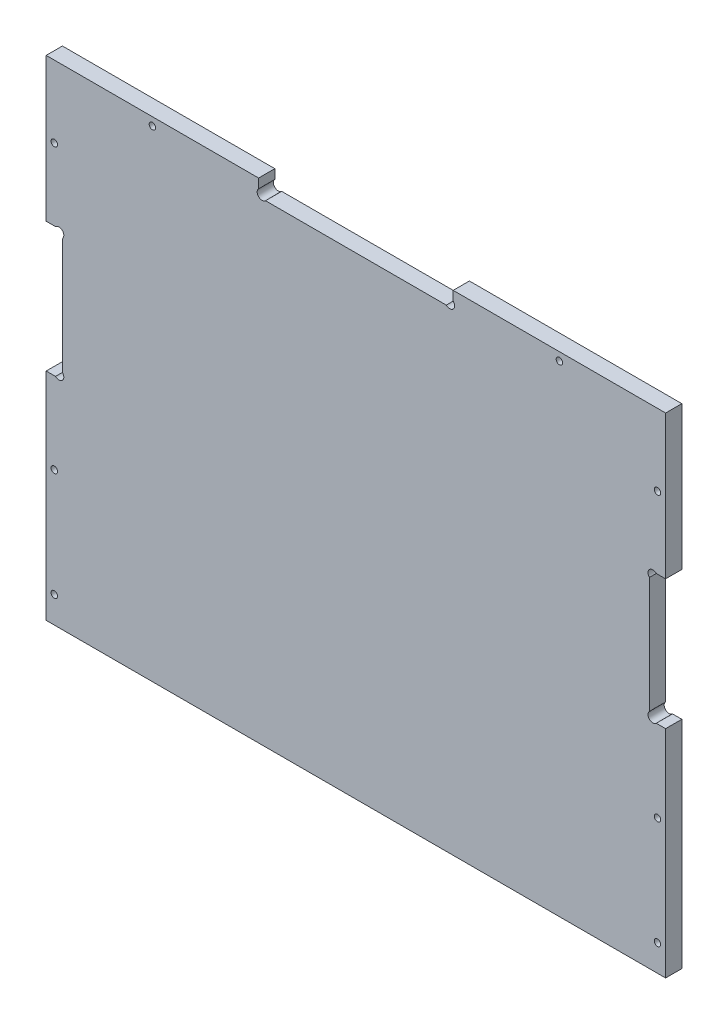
ISO-10303-21;
HEADER;
FILE_DESCRIPTION(('STEP AP214'),'2;1');
FILE_NAME('part.step','',(''),(''),'','','');
FILE_SCHEMA(('AUTOMOTIVE_DESIGN { 1 0 10303 214 1 1 1 1 }'));
ENDSEC;
DATA;
#1=APPLICATION_CONTEXT('core data for automotive mechanical design processes');
#2=APPLICATION_PROTOCOL_DEFINITION('international standard','automotive_design',2000,#1);
#3=PRODUCT_CONTEXT('',#1,'mechanical');
#4=PRODUCT('Part','Part','',(#3));
#5=PRODUCT_RELATED_PRODUCT_CATEGORY('part','',(#4));
#6=PRODUCT_DEFINITION_FORMATION('','',#4);
#7=PRODUCT_DEFINITION_CONTEXT('part definition',#1,'design');
#8=PRODUCT_DEFINITION('design','',#6,#7);
#9=PRODUCT_DEFINITION_SHAPE('','',#8);
#10=(LENGTH_UNIT() NAMED_UNIT(*) SI_UNIT(.MILLI.,.METRE.));
#11=(NAMED_UNIT(*) PLANE_ANGLE_UNIT() SI_UNIT($,.RADIAN.));
#12=(NAMED_UNIT(*) SI_UNIT($,.STERADIAN.) SOLID_ANGLE_UNIT());
#13=UNCERTAINTY_MEASURE_WITH_UNIT(LENGTH_MEASURE(1.E-05),#10,'distance_accuracy_value','');
#14=(GEOMETRIC_REPRESENTATION_CONTEXT(3) GLOBAL_UNCERTAINTY_ASSIGNED_CONTEXT((#13)) GLOBAL_UNIT_ASSIGNED_CONTEXT((#10,
#11,#12)) REPRESENTATION_CONTEXT('',''));
#15=CARTESIAN_POINT('',(0.,0.,0.));
#16=DIRECTION('',(0.,0.,1.));
#17=DIRECTION('',(1.,0.,0.));
#18=AXIS2_PLACEMENT_3D('',#15,#16,#17);
#19=CARTESIAN_POINT('',(-28.9393398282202,33.5075357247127,5.));
#20=DIRECTION('',(0.,0.,-1.));
#21=DIRECTION('',(-1.,0.,0.));
#22=AXIS2_PLACEMENT_3D('',#19,#20,#21);
#23=CYLINDRICAL_SURFACE('',#22,1.5);
#24=CARTESIAN_POINT('',(-28.9393398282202,33.5075357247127,0.));
#25=DIRECTION('',(0.,0.,1.));
#26=DIRECTION('',(1.,0.,0.));
#27=AXIS2_PLACEMENT_3D('',#24,#25,#26);
#28=CIRCLE('',#27,1.5);
#29=CARTESIAN_POINT('',(-30.,34.5681958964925,0.));
#30=VERTEX_POINT('',#29);
#31=CARTESIAN_POINT('',(-27.8786796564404,32.4468755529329,0.));
#32=VERTEX_POINT('',#31);
#33=EDGE_CURVE('E237',#30,#32,#28,.T.);
#34=ORIENTED_EDGE('',*,*,#33,.F.);
#35=DIRECTION('',(0.,0.,-1.));
#36=VECTOR('',#35,1.);
#37=CARTESIAN_POINT('',(-30.,34.5681958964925,5.));
#38=LINE('',#37,#36);
#39=CARTESIAN_POINT('',(-30.,34.5681958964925,5.));
#40=VERTEX_POINT('',#39);
#41=EDGE_CURVE('E11',#40,#30,#38,.T.);
#42=ORIENTED_EDGE('',*,*,#41,.F.);
#43=CARTESIAN_POINT('',(-28.9393398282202,33.5075357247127,5.));
#44=DIRECTION('',(0.,0.,1.));
#45=DIRECTION('',(1.,0.,0.));
#46=AXIS2_PLACEMENT_3D('',#43,#44,#45);
#47=CIRCLE('',#46,1.5);
#48=CARTESIAN_POINT('',(-27.8786796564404,32.4468755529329,5.));
#49=VERTEX_POINT('',#48);
#50=EDGE_CURVE('E318',#40,#49,#47,.T.);
#51=ORIENTED_EDGE('',*,*,#50,.T.);
#52=DIRECTION('',(0.,0.,-1.));
#53=VECTOR('',#52,1.);
#54=CARTESIAN_POINT('',(-27.8786796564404,32.4468755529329,5.));
#55=LINE('',#54,#53);
#56=EDGE_CURVE('E50',#49,#32,#55,.T.);
#57=ORIENTED_EDGE('',*,*,#56,.T.);
#58=EDGE_LOOP('',(#34,#42,#51,#57));
#59=FACE_BOUND('',#58,.T.);
#60=ADVANCED_FACE('F34',(#59),#23,.F.);
#61=CARTESIAN_POINT('',(-30.,0.,5.));
#62=DIRECTION('',(-1.,0.,0.));
#63=DIRECTION('',(0.,0.,1.));
#64=AXIS2_PLACEMENT_3D('',#61,#62,#63);
#65=PLANE('',#64);
#66=DIRECTION('',(0.,1.,0.));
#67=VECTOR('',#66,1.);
#68=CARTESIAN_POINT('',(-30.,0.,0.));
#69=LINE('',#68,#67);
#70=CARTESIAN_POINT('',(-30.,37.4468755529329,0.));
#71=VERTEX_POINT('',#70);
#72=EDGE_CURVE('E239',#30,#71,#69,.T.);
#73=ORIENTED_EDGE('',*,*,#72,.T.);
#74=DIRECTION('',(0.,0.,-1.));
#75=VECTOR('',#74,1.);
#76=CARTESIAN_POINT('',(-30.,37.4468755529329,5.));
#77=LINE('',#76,#75);
#78=CARTESIAN_POINT('',(-30.,37.4468755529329,5.));
#79=VERTEX_POINT('',#78);
#80=EDGE_CURVE('E42',#79,#71,#77,.T.);
#81=ORIENTED_EDGE('',*,*,#80,.F.);
#82=DIRECTION('',(0.,1.,0.));
#83=VECTOR('',#82,1.);
#84=CARTESIAN_POINT('',(-30.,0.,5.));
#85=LINE('',#84,#83);
#86=EDGE_CURVE('E791',#40,#79,#85,.T.);
#87=ORIENTED_EDGE('',*,*,#86,.F.);
#88=ORIENTED_EDGE('',*,*,#41,.T.);
#89=EDGE_LOOP('',(#73,#81,#87,#88));
#90=FACE_BOUND('',#89,.T.);
#91=ADVANCED_FACE('F439',(#90),#65,.F.);
#92=CARTESIAN_POINT('',(0.,37.4468755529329,5.));
#93=DIRECTION('',(0.,-1.,0.));
#94=DIRECTION('',(1.,0.,0.));
#95=AXIS2_PLACEMENT_3D('',#92,#93,#94);
#96=PLANE('',#95);
#97=DIRECTION('',(-1.,0.,0.));
#98=VECTOR('',#97,1.);
#99=CARTESIAN_POINT('',(0.,37.4468755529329,0.));
#100=LINE('',#99,#98);
#101=CARTESIAN_POINT('',(-95.5,37.4468755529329,0.));
#102=VERTEX_POINT('',#101);
#103=EDGE_CURVE('E241',#71,#102,#100,.T.);
#104=ORIENTED_EDGE('',*,*,#103,.T.);
#105=DIRECTION('',(0.,0.,-1.));
#106=VECTOR('',#105,1.);
#107=CARTESIAN_POINT('',(-95.5,37.4468755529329,5.));
#108=LINE('',#107,#106);
#109=CARTESIAN_POINT('',(-95.5,37.4468755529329,5.));
#110=VERTEX_POINT('',#109);
#111=EDGE_CURVE('E355',#110,#102,#108,.T.);
#112=ORIENTED_EDGE('',*,*,#111,.F.);
#113=DIRECTION('',(-1.,0.,0.));
#114=VECTOR('',#113,1.);
#115=CARTESIAN_POINT('',(0.,37.4468755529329,5.));
#116=LINE('',#115,#114);
#117=EDGE_CURVE('E364',#79,#110,#116,.T.);
#118=ORIENTED_EDGE('',*,*,#117,.F.);
#119=ORIENTED_EDGE('',*,*,#80,.T.);
#120=EDGE_LOOP('',(#104,#112,#118,#119));
#121=FACE_BOUND('',#120,.T.);
#122=ADVANCED_FACE('F362',(#121),#96,.F.);
#123=CARTESIAN_POINT('',(-95.5,0.,5.));
#124=DIRECTION('',(1.,0.,0.));
#125=DIRECTION('',(0.,0.,-1.));
#126=AXIS2_PLACEMENT_3D('',#123,#124,#125);
#127=PLANE('',#126);
#128=DIRECTION('',(0.,-1.,0.));
#129=VECTOR('',#128,1.);
#130=CARTESIAN_POINT('',(-95.5,0.,0.));
#131=LINE('',#130,#129);
#132=CARTESIAN_POINT('',(-95.5,-6.8431244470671,0.));
#133=VERTEX_POINT('',#132);
#134=EDGE_CURVE('E243',#102,#133,#131,.T.);
#135=ORIENTED_EDGE('',*,*,#134,.T.);
#136=DIRECTION('',(0.,0.,-1.));
#137=VECTOR('',#136,1.);
#138=CARTESIAN_POINT('',(-95.5,-6.8431244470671,5.));
#139=LINE('',#138,#137);
#140=CARTESIAN_POINT('',(-95.5,-6.8431244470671,5.));
#141=VERTEX_POINT('',#140);
#142=EDGE_CURVE('E352',#141,#133,#139,.T.);
#143=ORIENTED_EDGE('',*,*,#142,.F.);
#144=DIRECTION('',(0.,-1.,0.));
#145=VECTOR('',#144,1.);
#146=CARTESIAN_POINT('',(-95.5,0.,5.));
#147=LINE('',#146,#145);
#148=EDGE_CURVE('E384',#110,#141,#147,.T.);
#149=ORIENTED_EDGE('',*,*,#148,.F.);
#150=ORIENTED_EDGE('',*,*,#111,.T.);
#151=EDGE_LOOP('',(#135,#143,#149,#150));
#152=FACE_BOUND('',#151,.T.);
#153=ADVANCED_FACE('F374',(#152),#127,.F.);
#154=CARTESIAN_POINT('',(0.,-6.84312444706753,5.));
#155=DIRECTION('',(0.,1.,0.));
#156=DIRECTION('',(-1.,0.,0.));
#157=AXIS2_PLACEMENT_3D('',#154,#155,#156);
#158=PLANE('',#157);
#159=DIRECTION('',(1.,0.,0.));
#160=VECTOR('',#159,1.);
#161=CARTESIAN_POINT('',(0.,-6.84312444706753,0.));
#162=LINE('',#161,#160);
#163=CARTESIAN_POINT('',(-92.6213203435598,-6.84312444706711,0.));
#164=VERTEX_POINT('',#163);
#165=EDGE_CURVE('E245',#133,#164,#162,.T.);
#166=ORIENTED_EDGE('',*,*,#165,.T.);
#167=DIRECTION('',(0.,0.,-1.));
#168=VECTOR('',#167,1.);
#169=CARTESIAN_POINT('',(-92.6213203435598,-6.84312444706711,5.));
#170=LINE('',#169,#168);
#171=CARTESIAN_POINT('',(-92.6213203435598,-6.84312444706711,5.));
#172=VERTEX_POINT('',#171);
#173=EDGE_CURVE('E350',#172,#164,#170,.T.);
#174=ORIENTED_EDGE('',*,*,#173,.F.);
#175=DIRECTION('',(1.,0.,0.));
#176=VECTOR('',#175,1.);
#177=CARTESIAN_POINT('',(0.,-6.84312444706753,5.));
#178=LINE('',#177,#176);
#179=EDGE_CURVE('E380',#141,#172,#178,.T.);
#180=ORIENTED_EDGE('',*,*,#179,.F.);
#181=ORIENTED_EDGE('',*,*,#142,.T.);
#182=EDGE_LOOP('',(#166,#174,#180,#181));
#183=FACE_BOUND('',#182,.T.);
#184=ADVANCED_FACE('F378',(#183),#158,.F.);
#185=CARTESIAN_POINT('',(-91.5606601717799,-7.90378461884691,5.));
#186=DIRECTION('',(0.,0.,-1.));
#187=DIRECTION('',(-1.,0.,0.));
#188=AXIS2_PLACEMENT_3D('',#185,#186,#187);
#189=CYLINDRICAL_SURFACE('',#188,1.50000000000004);
#190=CARTESIAN_POINT('',(-91.5606601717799,-7.90378461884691,0.));
#191=DIRECTION('',(0.,0.,1.));
#192=DIRECTION('',(1.,0.,0.));
#193=AXIS2_PLACEMENT_3D('',#190,#191,#192);
#194=CIRCLE('',#193,1.50000000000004);
#195=CARTESIAN_POINT('',(-90.4999999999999,-8.96444479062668,0.));
#196=VERTEX_POINT('',#195);
#197=EDGE_CURVE('E248',#196,#164,#194,.T.);
#198=ORIENTED_EDGE('',*,*,#197,.F.);
#199=DIRECTION('',(0.,0.,-1.));
#200=VECTOR('',#199,1.);
#201=CARTESIAN_POINT('',(-90.4999999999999,-8.96444479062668,5.));
#202=LINE('',#201,#200);
#203=CARTESIAN_POINT('',(-90.4999999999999,-8.96444479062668,5.));
#204=VERTEX_POINT('',#203);
#205=EDGE_CURVE('E348',#204,#196,#202,.T.);
#206=ORIENTED_EDGE('',*,*,#205,.F.);
#207=CARTESIAN_POINT('',(-91.5606601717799,-7.90378461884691,5.));
#208=DIRECTION('',(0.,0.,1.));
#209=DIRECTION('',(1.,0.,0.));
#210=AXIS2_PLACEMENT_3D('',#207,#208,#209);
#211=CIRCLE('',#210,1.50000000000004);
#212=EDGE_CURVE('E383',#204,#172,#211,.T.);
#213=ORIENTED_EDGE('',*,*,#212,.T.);
#214=ORIENTED_EDGE('',*,*,#173,.T.);
#215=EDGE_LOOP('',(#198,#206,#213,#214));
#216=FACE_BOUND('',#215,.T.);
#217=ADVANCED_FACE('F452',(#216),#189,.F.);
#218=CARTESIAN_POINT('',(-90.4999999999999,0.,5.));
#219=DIRECTION('',(1.,0.,0.));
#220=DIRECTION('',(0.,1.,0.));
#221=AXIS2_PLACEMENT_3D('',#218,#219,#220);
#222=PLANE('',#221);
#223=DIRECTION('',(0.,-1.,0.));
#224=VECTOR('',#223,1.);
#225=CARTESIAN_POINT('',(-90.4999999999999,0.,0.));
#226=LINE('',#225,#224);
#227=CARTESIAN_POINT('',(-90.4999999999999,-44.7218041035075,0.));
#228=VERTEX_POINT('',#227);
#229=EDGE_CURVE('E251',#196,#228,#226,.T.);
#230=ORIENTED_EDGE('',*,*,#229,.T.);
#231=DIRECTION('',(0.,0.,-1.));
#232=VECTOR('',#231,1.);
#233=CARTESIAN_POINT('',(-90.4999999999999,-44.7218041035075,5.));
#234=LINE('',#233,#232);
#235=CARTESIAN_POINT('',(-90.4999999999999,-44.7218041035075,5.));
#236=VERTEX_POINT('',#235);
#237=EDGE_CURVE('E346',#236,#228,#234,.T.);
#238=ORIENTED_EDGE('',*,*,#237,.F.);
#239=DIRECTION('',(0.,-1.,0.));
#240=VECTOR('',#239,1.);
#241=CARTESIAN_POINT('',(-90.4999999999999,0.,5.));
#242=LINE('',#241,#240);
#243=EDGE_CURVE('E386',#204,#236,#242,.T.);
#244=ORIENTED_EDGE('',*,*,#243,.F.);
#245=ORIENTED_EDGE('',*,*,#205,.T.);
#246=EDGE_LOOP('',(#230,#238,#244,#245));
#247=FACE_BOUND('',#246,.T.);
#248=ADVANCED_FACE('F455',(#247),#222,.F.);
#249=CARTESIAN_POINT('',(-91.5606601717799,-45.7824642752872,5.));
#250=DIRECTION('',(0.,0.,-1.));
#251=DIRECTION('',(-1.,0.,0.));
#252=AXIS2_PLACEMENT_3D('',#249,#250,#251);
#253=CYLINDRICAL_SURFACE('',#252,1.50000000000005);
#254=CARTESIAN_POINT('',(-91.5606601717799,-45.7824642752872,0.));
#255=DIRECTION('',(0.,0.,1.));
#256=DIRECTION('',(1.,0.,0.));
#257=AXIS2_PLACEMENT_3D('',#254,#255,#256);
#258=CIRCLE('',#257,1.50000000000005);
#259=CARTESIAN_POINT('',(-92.6213203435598,-46.843124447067,0.));
#260=VERTEX_POINT('',#259);
#261=EDGE_CURVE('E254',#260,#228,#258,.T.);
#262=ORIENTED_EDGE('',*,*,#261,.F.);
#263=DIRECTION('',(0.,0.,-1.));
#264=VECTOR('',#263,1.);
#265=CARTESIAN_POINT('',(-92.6213203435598,-46.843124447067,5.));
#266=LINE('',#265,#264);
#267=CARTESIAN_POINT('',(-92.6213203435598,-46.843124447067,5.));
#268=VERTEX_POINT('',#267);
#269=EDGE_CURVE('E344',#268,#260,#266,.T.);
#270=ORIENTED_EDGE('',*,*,#269,.F.);
#271=CARTESIAN_POINT('',(-91.5606601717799,-45.7824642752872,5.));
#272=DIRECTION('',(0.,0.,1.));
#273=DIRECTION('',(1.,0.,0.));
#274=AXIS2_PLACEMENT_3D('',#271,#272,#273);
#275=CIRCLE('',#274,1.50000000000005);
#276=EDGE_CURVE('E392',#268,#236,#275,.T.);
#277=ORIENTED_EDGE('',*,*,#276,.T.);
#278=ORIENTED_EDGE('',*,*,#237,.T.);
#279=EDGE_LOOP('',(#262,#270,#277,#278));
#280=FACE_BOUND('',#279,.T.);
#281=ADVANCED_FACE('F459',(#280),#253,.F.);
#282=CARTESIAN_POINT('',(3.3873807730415E-13,-46.8431244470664,5.));
#283=DIRECTION('',(0.,-1.,0.));
#284=DIRECTION('',(1.,0.,0.));
#285=AXIS2_PLACEMENT_3D('',#282,#283,#284);
#286=PLANE('',#285);
#287=DIRECTION('',(-1.,0.,0.));
#288=VECTOR('',#287,1.);
#289=CARTESIAN_POINT('',(3.3873807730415E-13,-46.8431244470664,0.));
#290=LINE('',#289,#288);
#291=CARTESIAN_POINT('',(-95.5000000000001,-46.8431244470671,0.));
#292=VERTEX_POINT('',#291);
#293=EDGE_CURVE('E257',#260,#292,#290,.T.);
#294=ORIENTED_EDGE('',*,*,#293,.T.);
#295=DIRECTION('',(0.,0.,-1.));
#296=VECTOR('',#295,1.);
#297=CARTESIAN_POINT('',(-95.5000000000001,-46.8431244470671,5.));
#298=LINE('',#297,#296);
#299=CARTESIAN_POINT('',(-95.5000000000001,-46.8431244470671,5.));
#300=VERTEX_POINT('',#299);
#301=EDGE_CURVE('E341',#300,#292,#298,.T.);
#302=ORIENTED_EDGE('',*,*,#301,.F.);
#303=DIRECTION('',(-1.,0.,0.));
#304=VECTOR('',#303,1.);
#305=CARTESIAN_POINT('',(3.3873807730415E-13,-46.8431244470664,5.));
#306=LINE('',#305,#304);
#307=EDGE_CURVE('E395',#268,#300,#306,.T.);
#308=ORIENTED_EDGE('',*,*,#307,.F.);
#309=ORIENTED_EDGE('',*,*,#269,.T.);
#310=EDGE_LOOP('',(#294,#302,#308,#309));
#311=FACE_BOUND('',#310,.T.);
#312=ADVANCED_FACE('F463',(#311),#286,.F.);
#313=CARTESIAN_POINT('',(-95.5000000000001,0.,5.));
#314=DIRECTION('',(1.,0.,0.));
#315=DIRECTION('',(0.,1.,0.));
#316=AXIS2_PLACEMENT_3D('',#313,#314,#315);
#317=PLANE('',#316);
#318=DIRECTION('',(0.,-1.,0.));
#319=VECTOR('',#318,1.);
#320=CARTESIAN_POINT('',(-95.5000000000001,0.,0.));
#321=LINE('',#320,#319);
#322=CARTESIAN_POINT('',(-95.5,-113.433124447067,0.));
#323=VERTEX_POINT('',#322);
#324=EDGE_CURVE('E259',#292,#323,#321,.T.);
#325=ORIENTED_EDGE('',*,*,#324,.T.);
#326=DIRECTION('',(0.,0.,-1.));
#327=VECTOR('',#326,1.);
#328=CARTESIAN_POINT('',(-95.5,-113.433124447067,5.));
#329=LINE('',#328,#327);
#330=CARTESIAN_POINT('',(-95.5,-113.433124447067,5.));
#331=VERTEX_POINT('',#330);
#332=EDGE_CURVE('E338',#331,#323,#329,.T.);
#333=ORIENTED_EDGE('',*,*,#332,.F.);
#334=DIRECTION('',(0.,-1.,0.));
#335=VECTOR('',#334,1.);
#336=CARTESIAN_POINT('',(-95.5000000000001,0.,5.));
#337=LINE('',#336,#335);
#338=EDGE_CURVE('E397',#300,#331,#337,.T.);
#339=ORIENTED_EDGE('',*,*,#338,.F.);
#340=ORIENTED_EDGE('',*,*,#301,.T.);
#341=EDGE_LOOP('',(#325,#333,#339,#340));
#342=FACE_BOUND('',#341,.T.);
#343=ADVANCED_FACE('F467',(#342),#317,.F.);
#344=CARTESIAN_POINT('',(0.,-113.433124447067,5.));
#345=DIRECTION('',(0.,1.,0.));
#346=DIRECTION('',(0.,0.,1.));
#347=AXIS2_PLACEMENT_3D('',#344,#345,#346);
#348=PLANE('',#347);
#349=DIRECTION('',(1.,0.,0.));
#350=VECTOR('',#349,1.);
#351=CARTESIAN_POINT('',(0.,-113.433124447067,0.));
#352=LINE('',#351,#350);
#353=CARTESIAN_POINT('',(95.5,-113.433124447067,0.));
#354=VERTEX_POINT('',#353);
#355=EDGE_CURVE('E261',#323,#354,#352,.T.);
#356=ORIENTED_EDGE('',*,*,#355,.T.);
#357=DIRECTION('',(0.,0.,-1.));
#358=VECTOR('',#357,1.);
#359=CARTESIAN_POINT('',(95.5,-113.433124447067,5.));
#360=LINE('',#359,#358);
#361=CARTESIAN_POINT('',(95.5,-113.433124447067,5.));
#362=VERTEX_POINT('',#361);
#363=EDGE_CURVE('E336',#362,#354,#360,.T.);
#364=ORIENTED_EDGE('',*,*,#363,.F.);
#365=DIRECTION('',(1.,0.,0.));
#366=VECTOR('',#365,1.);
#367=CARTESIAN_POINT('',(0.,-113.433124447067,5.));
#368=LINE('',#367,#366);
#369=EDGE_CURVE('E399',#331,#362,#368,.T.);
#370=ORIENTED_EDGE('',*,*,#369,.F.);
#371=ORIENTED_EDGE('',*,*,#332,.T.);
#372=EDGE_LOOP('',(#356,#364,#370,#371));
#373=FACE_BOUND('',#372,.T.);
#374=ADVANCED_FACE('F471',(#373),#348,.F.);
#375=CARTESIAN_POINT('',(95.5000000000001,0.,5.));
#376=DIRECTION('',(1.,0.,0.));
#377=DIRECTION('',(0.,1.,0.));
#378=AXIS2_PLACEMENT_3D('',#375,#376,#377);
#379=PLANE('',#378);
#380=DIRECTION('',(0.,-1.,0.));
#381=VECTOR('',#380,1.);
#382=CARTESIAN_POINT('',(95.5000000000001,0.,0.));
#383=LINE('',#382,#381);
#384=CARTESIAN_POINT('',(95.5000000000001,-46.8431244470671,0.));
#385=VERTEX_POINT('',#384);
#386=EDGE_CURVE('E264',#385,#354,#383,.T.);
#387=ORIENTED_EDGE('',*,*,#386,.F.);
#388=DIRECTION('',(0.,0.,-1.));
#389=VECTOR('',#388,1.);
#390=CARTESIAN_POINT('',(95.5000000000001,-46.8431244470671,5.));
#391=LINE('',#390,#389);
#392=CARTESIAN_POINT('',(95.5000000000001,-46.8431244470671,5.));
#393=VERTEX_POINT('',#392);
#394=EDGE_CURVE('E334',#393,#385,#391,.T.);
#395=ORIENTED_EDGE('',*,*,#394,.F.);
#396=DIRECTION('',(0.,-1.,0.));
#397=VECTOR('',#396,1.);
#398=CARTESIAN_POINT('',(95.5000000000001,0.,5.));
#399=LINE('',#398,#397);
#400=EDGE_CURVE('E401',#393,#362,#399,.T.);
#401=ORIENTED_EDGE('',*,*,#400,.T.);
#402=ORIENTED_EDGE('',*,*,#363,.T.);
#403=EDGE_LOOP('',(#387,#395,#401,#402));
#404=FACE_BOUND('',#403,.T.);
#405=ADVANCED_FACE('F475',(#404),#379,.T.);
#406=CARTESIAN_POINT('',(-1.12912692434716E-13,-46.8431244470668,5.));
#407=DIRECTION('',(0.,1.,0.));
#408=DIRECTION('',(-1.,0.,0.));
#409=AXIS2_PLACEMENT_3D('',#406,#407,#408);
#410=PLANE('',#409);
#411=DIRECTION('',(1.,0.,0.));
#412=VECTOR('',#411,1.);
#413=CARTESIAN_POINT('',(-1.12912692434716E-13,-46.8431244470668,0.));
#414=LINE('',#413,#412);
#415=CARTESIAN_POINT('',(92.6213203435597,-46.8431244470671,0.));
#416=VERTEX_POINT('',#415);
#417=EDGE_CURVE('E267',#416,#385,#414,.T.);
#418=ORIENTED_EDGE('',*,*,#417,.F.);
#419=DIRECTION('',(0.,0.,-1.));
#420=VECTOR('',#419,1.);
#421=CARTESIAN_POINT('',(92.6213203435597,-46.8431244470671,5.));
#422=LINE('',#421,#420);
#423=CARTESIAN_POINT('',(92.6213203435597,-46.8431244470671,5.));
#424=VERTEX_POINT('',#423);
#425=EDGE_CURVE('E332',#424,#416,#422,.T.);
#426=ORIENTED_EDGE('',*,*,#425,.F.);
#427=DIRECTION('',(1.,0.,0.));
#428=VECTOR('',#427,1.);
#429=CARTESIAN_POINT('',(-1.12912692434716E-13,-46.8431244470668,5.));
#430=LINE('',#429,#428);
#431=EDGE_CURVE('E404',#424,#393,#430,.T.);
#432=ORIENTED_EDGE('',*,*,#431,.T.);
#433=ORIENTED_EDGE('',*,*,#394,.T.);
#434=EDGE_LOOP('',(#418,#426,#432,#433));
#435=FACE_BOUND('',#434,.T.);
#436=ADVANCED_FACE('F479',(#435),#410,.T.);
#437=CARTESIAN_POINT('',(91.5606601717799,-45.7824642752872,5.));
#438=DIRECTION('',(0.,0.,-1.));
#439=DIRECTION('',(-1.,0.,0.));
#440=AXIS2_PLACEMENT_3D('',#437,#438,#439);
#441=CYLINDRICAL_SURFACE('',#440,1.50000000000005);
#442=CARTESIAN_POINT('',(91.5606601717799,-45.7824642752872,0.));
#443=DIRECTION('',(0.,0.,1.));
#444=DIRECTION('',(1.,0.,0.));
#445=AXIS2_PLACEMENT_3D('',#442,#443,#444);
#446=CIRCLE('',#445,1.50000000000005);
#447=CARTESIAN_POINT('',(90.4999999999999,-44.7218041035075,0.));
#448=VERTEX_POINT('',#447);
#449=EDGE_CURVE('E270',#416,#448,#446,.F.);
#450=ORIENTED_EDGE('',*,*,#449,.T.);
#451=DIRECTION('',(0.,0.,-1.));
#452=VECTOR('',#451,1.);
#453=CARTESIAN_POINT('',(90.4999999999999,-44.7218041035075,5.));
#454=LINE('',#453,#452);
#455=CARTESIAN_POINT('',(90.4999999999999,-44.7218041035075,5.));
#456=VERTEX_POINT('',#455);
#457=EDGE_CURVE('E330',#456,#448,#454,.T.);
#458=ORIENTED_EDGE('',*,*,#457,.F.);
#459=CARTESIAN_POINT('',(91.5606601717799,-45.7824642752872,5.));
#460=DIRECTION('',(0.,0.,1.));
#461=DIRECTION('',(1.,0.,0.));
#462=AXIS2_PLACEMENT_3D('',#459,#460,#461);
#463=CIRCLE('',#462,1.50000000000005);
#464=EDGE_CURVE('E407',#424,#456,#463,.F.);
#465=ORIENTED_EDGE('',*,*,#464,.F.);
#466=ORIENTED_EDGE('',*,*,#425,.T.);
#467=EDGE_LOOP('',(#450,#458,#465,#466));
#468=FACE_BOUND('',#467,.T.);
#469=ADVANCED_FACE('F483',(#468),#441,.F.);
#470=CARTESIAN_POINT('',(90.4999999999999,0.,5.));
#471=DIRECTION('',(1.,0.,0.));
#472=DIRECTION('',(0.,0.,-1.));
#473=AXIS2_PLACEMENT_3D('',#470,#471,#472);
#474=PLANE('',#473);
#475=DIRECTION('',(0.,-1.,0.));
#476=VECTOR('',#475,1.);
#477=CARTESIAN_POINT('',(90.4999999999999,0.,0.));
#478=LINE('',#477,#476);
#479=CARTESIAN_POINT('',(90.4999999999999,-8.96444479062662,0.));
#480=VERTEX_POINT('',#479);
#481=EDGE_CURVE('E273',#480,#448,#478,.T.);
#482=ORIENTED_EDGE('',*,*,#481,.F.);
#483=DIRECTION('',(0.,0.,-1.));
#484=VECTOR('',#483,1.);
#485=CARTESIAN_POINT('',(90.4999999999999,-8.96444479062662,5.));
#486=LINE('',#485,#484);
#487=CARTESIAN_POINT('',(90.4999999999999,-8.96444479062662,5.));
#488=VERTEX_POINT('',#487);
#489=EDGE_CURVE('E328',#488,#480,#486,.T.);
#490=ORIENTED_EDGE('',*,*,#489,.F.);
#491=DIRECTION('',(0.,-1.,0.));
#492=VECTOR('',#491,1.);
#493=CARTESIAN_POINT('',(90.4999999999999,0.,5.));
#494=LINE('',#493,#492);
#495=EDGE_CURVE('E409',#488,#456,#494,.T.);
#496=ORIENTED_EDGE('',*,*,#495,.T.);
#497=ORIENTED_EDGE('',*,*,#457,.T.);
#498=EDGE_LOOP('',(#482,#490,#496,#497));
#499=FACE_BOUND('',#498,.T.);
#500=ADVANCED_FACE('F487',(#499),#474,.T.);
#501=CARTESIAN_POINT('',(91.5606601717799,-7.90378461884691,5.));
#502=DIRECTION('',(0.,0.,-1.));
#503=DIRECTION('',(-1.,0.,0.));
#504=AXIS2_PLACEMENT_3D('',#501,#502,#503);
#505=CYLINDRICAL_SURFACE('',#504,1.50000000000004);
#506=CARTESIAN_POINT('',(91.5606601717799,-7.90378461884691,0.));
#507=DIRECTION('',(0.,0.,1.));
#508=DIRECTION('',(1.,0.,0.));
#509=AXIS2_PLACEMENT_3D('',#506,#507,#508);
#510=CIRCLE('',#509,1.50000000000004);
#511=CARTESIAN_POINT('',(92.6213203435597,-6.8431244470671,0.));
#512=VERTEX_POINT('',#511);
#513=EDGE_CURVE('E276',#480,#512,#510,.F.);
#514=ORIENTED_EDGE('',*,*,#513,.T.);
#515=DIRECTION('',(0.,0.,-1.));
#516=VECTOR('',#515,1.);
#517=CARTESIAN_POINT('',(92.6213203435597,-6.8431244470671,5.));
#518=LINE('',#517,#516);
#519=CARTESIAN_POINT('',(92.6213203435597,-6.8431244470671,5.));
#520=VERTEX_POINT('',#519);
#521=EDGE_CURVE('E326',#520,#512,#518,.T.);
#522=ORIENTED_EDGE('',*,*,#521,.F.);
#523=CARTESIAN_POINT('',(91.5606601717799,-7.90378461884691,5.));
#524=DIRECTION('',(0.,0.,1.));
#525=DIRECTION('',(1.,0.,0.));
#526=AXIS2_PLACEMENT_3D('',#523,#524,#525);
#527=CIRCLE('',#526,1.50000000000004);
#528=EDGE_CURVE('E412',#488,#520,#527,.F.);
#529=ORIENTED_EDGE('',*,*,#528,.F.);
#530=ORIENTED_EDGE('',*,*,#489,.T.);
#531=EDGE_LOOP('',(#514,#522,#529,#530));
#532=FACE_BOUND('',#531,.T.);
#533=ADVANCED_FACE('F491',(#532),#505,.F.);
#534=CARTESIAN_POINT('',(0.,-6.8431244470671,5.));
#535=DIRECTION('',(0.,-1.,0.));
#536=DIRECTION('',(0.,0.,-1.));
#537=AXIS2_PLACEMENT_3D('',#534,#535,#536);
#538=PLANE('',#537);
#539=DIRECTION('',(-1.,0.,0.));
#540=VECTOR('',#539,1.);
#541=CARTESIAN_POINT('',(0.,-6.8431244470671,0.));
#542=LINE('',#541,#540);
#543=CARTESIAN_POINT('',(95.5,-6.8431244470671,0.));
#544=VERTEX_POINT('',#543);
#545=EDGE_CURVE('E279',#544,#512,#542,.T.);
#546=ORIENTED_EDGE('',*,*,#545,.F.);
#547=DIRECTION('',(0.,0.,-1.));
#548=VECTOR('',#547,1.);
#549=CARTESIAN_POINT('',(95.5,-6.8431244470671,5.));
#550=LINE('',#549,#548);
#551=CARTESIAN_POINT('',(95.5,-6.8431244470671,5.));
#552=VERTEX_POINT('',#551);
#553=EDGE_CURVE('E324',#552,#544,#550,.T.);
#554=ORIENTED_EDGE('',*,*,#553,.F.);
#555=DIRECTION('',(-1.,0.,0.));
#556=VECTOR('',#555,1.);
#557=CARTESIAN_POINT('',(0.,-6.8431244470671,5.));
#558=LINE('',#557,#556);
#559=EDGE_CURVE('E414',#552,#520,#558,.T.);
#560=ORIENTED_EDGE('',*,*,#559,.T.);
#561=ORIENTED_EDGE('',*,*,#521,.T.);
#562=EDGE_LOOP('',(#546,#554,#560,#561));
#563=FACE_BOUND('',#562,.T.);
#564=ADVANCED_FACE('F495',(#563),#538,.T.);
#565=CARTESIAN_POINT('',(95.5,0.,5.));
#566=DIRECTION('',(1.,0.,0.));
#567=DIRECTION('',(0.,0.,-1.));
#568=AXIS2_PLACEMENT_3D('',#565,#566,#567);
#569=PLANE('',#568);
#570=DIRECTION('',(0.,-1.,0.));
#571=VECTOR('',#570,1.);
#572=CARTESIAN_POINT('',(95.5,0.,0.));
#573=LINE('',#572,#571);
#574=CARTESIAN_POINT('',(95.5,37.4468755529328,0.));
#575=VERTEX_POINT('',#574);
#576=EDGE_CURVE('E282',#575,#544,#573,.T.);
#577=ORIENTED_EDGE('',*,*,#576,.F.);
#578=DIRECTION('',(0.,0.,-1.));
#579=VECTOR('',#578,1.);
#580=CARTESIAN_POINT('',(95.5,37.4468755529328,5.));
#581=LINE('',#580,#579);
#582=CARTESIAN_POINT('',(95.5,37.4468755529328,5.));
#583=VERTEX_POINT('',#582);
#584=EDGE_CURVE('E322',#583,#575,#581,.T.);
#585=ORIENTED_EDGE('',*,*,#584,.F.);
#586=DIRECTION('',(0.,-1.,0.));
#587=VECTOR('',#586,1.);
#588=CARTESIAN_POINT('',(95.5,0.,5.));
#589=LINE('',#588,#587);
#590=EDGE_CURVE('E417',#583,#552,#589,.T.);
#591=ORIENTED_EDGE('',*,*,#590,.T.);
#592=ORIENTED_EDGE('',*,*,#553,.T.);
#593=EDGE_LOOP('',(#577,#585,#591,#592));
#594=FACE_BOUND('',#593,.T.);
#595=ADVANCED_FACE('F499',(#594),#569,.T.);
#596=CARTESIAN_POINT('',(0.,37.4468755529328,5.));
#597=DIRECTION('',(0.,1.,0.));
#598=DIRECTION('',(-1.,0.,0.));
#599=AXIS2_PLACEMENT_3D('',#596,#597,#598);
#600=PLANE('',#599);
#601=DIRECTION('',(1.,0.,0.));
#602=VECTOR('',#601,1.);
#603=CARTESIAN_POINT('',(0.,37.4468755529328,0.));
#604=LINE('',#603,#602);
#605=CARTESIAN_POINT('',(30.,37.4468755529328,0.));
#606=VERTEX_POINT('',#605);
#607=EDGE_CURVE('E285',#606,#575,#604,.T.);
#608=ORIENTED_EDGE('',*,*,#607,.F.);
#609=DIRECTION('',(0.,0.,-1.));
#610=VECTOR('',#609,1.);
#611=CARTESIAN_POINT('',(30.,37.4468755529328,5.));
#612=LINE('',#611,#610);
#613=CARTESIAN_POINT('',(30.,37.4468755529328,5.));
#614=VERTEX_POINT('',#613);
#615=EDGE_CURVE('E193',#614,#606,#612,.T.);
#616=ORIENTED_EDGE('',*,*,#615,.F.);
#617=DIRECTION('',(1.,0.,0.));
#618=VECTOR('',#617,1.);
#619=CARTESIAN_POINT('',(0.,37.4468755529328,5.));
#620=LINE('',#619,#618);
#621=EDGE_CURVE('E205',#614,#583,#620,.T.);
#622=ORIENTED_EDGE('',*,*,#621,.T.);
#623=ORIENTED_EDGE('',*,*,#584,.T.);
#624=EDGE_LOOP('',(#608,#616,#622,#623));
#625=FACE_BOUND('',#624,.T.);
#626=ADVANCED_FACE('F421',(#625),#600,.T.);
#627=CARTESIAN_POINT('',(29.9999999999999,-1.08469945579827E-13,5.));
#628=DIRECTION('',(-1.,0.,0.));
#629=DIRECTION('',(0.,-1.,0.));
#630=AXIS2_PLACEMENT_3D('',#627,#628,#629);
#631=PLANE('',#630);
#632=DIRECTION('',(0.,1.,0.));
#633=VECTOR('',#632,1.);
#634=CARTESIAN_POINT('',(29.9999999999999,-1.08469945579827E-13,0.));
#635=LINE('',#634,#633);
#636=CARTESIAN_POINT('',(30.,34.5681958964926,0.));
#637=VERTEX_POINT('',#636);
#638=EDGE_CURVE('E189',#637,#606,#635,.T.);
#639=ORIENTED_EDGE('',*,*,#638,.F.);
#640=DIRECTION('',(0.,0.,-1.));
#641=VECTOR('',#640,1.);
#642=CARTESIAN_POINT('',(30.,34.5681958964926,5.));
#643=LINE('',#642,#641);
#644=CARTESIAN_POINT('',(30.,34.5681958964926,5.));
#645=VERTEX_POINT('',#644);
#646=EDGE_CURVE('E184',#645,#637,#643,.T.);
#647=ORIENTED_EDGE('',*,*,#646,.F.);
#648=DIRECTION('',(0.,1.,0.));
#649=VECTOR('',#648,1.);
#650=CARTESIAN_POINT('',(29.9999999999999,-1.08469945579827E-13,5.));
#651=LINE('',#650,#649);
#652=EDGE_CURVE('E187',#645,#614,#651,.T.);
#653=ORIENTED_EDGE('',*,*,#652,.T.);
#654=ORIENTED_EDGE('',*,*,#615,.T.);
#655=EDGE_LOOP('',(#639,#647,#653,#654));
#656=FACE_BOUND('',#655,.T.);
#657=ADVANCED_FACE('F186',(#656),#631,.T.);
#658=CARTESIAN_POINT('',(28.9393398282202,33.5075357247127,5.));
#659=DIRECTION('',(0.,0.,-1.));
#660=DIRECTION('',(-1.,0.,0.));
#661=AXIS2_PLACEMENT_3D('',#658,#659,#660);
#662=CYLINDRICAL_SURFACE('',#661,1.50000000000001);
#663=CARTESIAN_POINT('',(28.9393398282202,33.5075357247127,0.));
#664=DIRECTION('',(0.,0.,1.));
#665=DIRECTION('',(1.,0.,0.));
#666=AXIS2_PLACEMENT_3D('',#663,#664,#665);
#667=CIRCLE('',#666,1.50000000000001);
#668=CARTESIAN_POINT('',(27.8786796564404,32.4468755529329,0.));
#669=VERTEX_POINT('',#668);
#670=EDGE_CURVE('E289',#669,#637,#667,.T.);
#671=ORIENTED_EDGE('',*,*,#670,.F.);
#672=DIRECTION('',(0.,0.,-1.));
#673=VECTOR('',#672,1.);
#674=CARTESIAN_POINT('',(27.8786796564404,32.4468755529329,5.));
#675=LINE('',#674,#673);
#676=CARTESIAN_POINT('',(27.8786796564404,32.4468755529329,5.));
#677=VERTEX_POINT('',#676);
#678=EDGE_CURVE('E117',#677,#669,#675,.T.);
#679=ORIENTED_EDGE('',*,*,#678,.F.);
#680=CARTESIAN_POINT('',(28.9393398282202,33.5075357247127,5.));
#681=DIRECTION('',(0.,0.,1.));
#682=DIRECTION('',(1.,0.,0.));
#683=AXIS2_PLACEMENT_3D('',#680,#681,#682);
#684=CIRCLE('',#683,1.50000000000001);
#685=EDGE_CURVE('E202',#677,#645,#684,.T.);
#686=ORIENTED_EDGE('',*,*,#685,.T.);
#687=ORIENTED_EDGE('',*,*,#646,.T.);
#688=EDGE_LOOP('',(#671,#679,#686,#687));
#689=FACE_BOUND('',#688,.T.);
#690=ADVANCED_FACE('F207',(#689),#662,.F.);
#691=CARTESIAN_POINT('',(93.,15.3018755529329,5.));
#692=DIRECTION('',(0.,0.,-1.));
#693=DIRECTION('',(-1.,0.,0.));
#694=AXIS2_PLACEMENT_3D('',#691,#692,#693);
#695=CYLINDRICAL_SURFACE('',#694,0.999999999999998);
#696=CARTESIAN_POINT('',(93.,15.3018755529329,5.));
#697=DIRECTION('',(0.,0.,1.));
#698=DIRECTION('',(1.,0.,0.));
#699=AXIS2_PLACEMENT_3D('',#696,#697,#698);
#700=CIRCLE('',#699,0.999999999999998);
#701=CARTESIAN_POINT('',(94.,15.3018755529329,5.));
#702=VERTEX_POINT('',#701);
#703=EDGE_CURVE('E231',#702,#702,#700,.F.);
#704=ORIENTED_EDGE('',*,*,#703,.F.);
#705=EDGE_LOOP('',(#704));
#706=FACE_BOUND('',#705,.T.);
#707=CARTESIAN_POINT('',(93.,15.3018755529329,0.));
#708=DIRECTION('',(0.,0.,1.));
#709=DIRECTION('',(1.,0.,0.));
#710=AXIS2_PLACEMENT_3D('',#707,#708,#709);
#711=CIRCLE('',#710,0.999999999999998);
#712=CARTESIAN_POINT('',(94.,15.3018755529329,0.));
#713=VERTEX_POINT('',#712);
#714=EDGE_CURVE('E312',#713,#713,#711,.F.);
#715=ORIENTED_EDGE('',*,*,#714,.T.);
#716=EDGE_LOOP('',(#715));
#717=FACE_BOUND('',#716,.T.);
#718=ADVANCED_FACE('F508',(#706,#717),#695,.F.);
#719=CARTESIAN_POINT('',(62.75,34.9468755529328,5.));
#720=DIRECTION('',(0.,0.,-1.));
#721=DIRECTION('',(-1.,0.,0.));
#722=AXIS2_PLACEMENT_3D('',#719,#720,#721);
#723=CYLINDRICAL_SURFACE('',#722,0.999999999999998);
#724=CARTESIAN_POINT('',(62.75,34.9468755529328,5.));
#725=DIRECTION('',(0.,0.,1.));
#726=DIRECTION('',(1.,0.,0.));
#727=AXIS2_PLACEMENT_3D('',#724,#725,#726);
#728=CIRCLE('',#727,0.999999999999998);
#729=CARTESIAN_POINT('',(63.75,34.9468755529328,5.));
#730=VERTEX_POINT('',#729);
#731=EDGE_CURVE('E228',#730,#730,#728,.F.);
#732=ORIENTED_EDGE('',*,*,#731,.F.);
#733=EDGE_LOOP('',(#732));
#734=FACE_BOUND('',#733,.T.);
#735=CARTESIAN_POINT('',(62.75,34.9468755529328,0.));
#736=DIRECTION('',(0.,0.,1.));
#737=DIRECTION('',(1.,0.,0.));
#738=AXIS2_PLACEMENT_3D('',#735,#736,#737);
#739=CIRCLE('',#738,0.999999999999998);
#740=CARTESIAN_POINT('',(63.75,34.9468755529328,0.));
#741=VERTEX_POINT('',#740);
#742=EDGE_CURVE('E309',#741,#741,#739,.F.);
#743=ORIENTED_EDGE('',*,*,#742,.T.);
#744=EDGE_LOOP('',(#743));
#745=FACE_BOUND('',#744,.T.);
#746=ADVANCED_FACE('F512',(#734,#745),#723,.F.);
#747=CARTESIAN_POINT('',(93.,-71.9581244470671,5.));
#748=DIRECTION('',(0.,0.,-1.));
#749=DIRECTION('',(-1.,0.,0.));
#750=AXIS2_PLACEMENT_3D('',#747,#748,#749);
#751=CYLINDRICAL_SURFACE('',#750,0.999999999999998);
#752=CARTESIAN_POINT('',(93.,-71.9581244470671,5.));
#753=DIRECTION('',(0.,0.,1.));
#754=DIRECTION('',(1.,0.,0.));
#755=AXIS2_PLACEMENT_3D('',#752,#753,#754);
#756=CIRCLE('',#755,0.999999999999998);
#757=CARTESIAN_POINT('',(94.,-71.9581244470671,5.));
#758=VERTEX_POINT('',#757);
#759=EDGE_CURVE('E225',#758,#758,#756,.F.);
#760=ORIENTED_EDGE('',*,*,#759,.F.);
#761=EDGE_LOOP('',(#760));
#762=FACE_BOUND('',#761,.T.);
#763=CARTESIAN_POINT('',(93.,-71.9581244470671,0.));
#764=DIRECTION('',(0.,0.,1.));
#765=DIRECTION('',(1.,0.,0.));
#766=AXIS2_PLACEMENT_3D('',#763,#764,#765);
#767=CIRCLE('',#766,0.999999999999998);
#768=CARTESIAN_POINT('',(94.,-71.9581244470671,0.));
#769=VERTEX_POINT('',#768);
#770=EDGE_CURVE('E306',#769,#769,#767,.F.);
#771=ORIENTED_EDGE('',*,*,#770,.T.);
#772=EDGE_LOOP('',(#771));
#773=FACE_BOUND('',#772,.T.);
#774=ADVANCED_FACE('F518',(#762,#773),#751,.F.);
#775=CARTESIAN_POINT('',(-93.,15.3018755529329,5.));
#776=DIRECTION('',(0.,0.,-1.));
#777=DIRECTION('',(-1.,0.,0.));
#778=AXIS2_PLACEMENT_3D('',#775,#776,#777);
#779=CYLINDRICAL_SURFACE('',#778,0.999999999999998);
#780=CARTESIAN_POINT('',(-93.,15.3018755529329,5.));
#781=DIRECTION('',(0.,0.,1.));
#782=DIRECTION('',(1.,0.,0.));
#783=AXIS2_PLACEMENT_3D('',#780,#781,#782);
#784=CIRCLE('',#783,0.999999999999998);
#785=CARTESIAN_POINT('',(-92.,15.3018755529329,5.));
#786=VERTEX_POINT('',#785);
#787=EDGE_CURVE('E222',#786,#786,#784,.T.);
#788=ORIENTED_EDGE('',*,*,#787,.T.);
#789=EDGE_LOOP('',(#788));
#790=FACE_BOUND('',#789,.T.);
#791=CARTESIAN_POINT('',(-93.,15.3018755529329,0.));
#792=DIRECTION('',(0.,0.,1.));
#793=DIRECTION('',(1.,0.,0.));
#794=AXIS2_PLACEMENT_3D('',#791,#792,#793);
#795=CIRCLE('',#794,0.999999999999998);
#796=CARTESIAN_POINT('',(-92.,15.3018755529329,0.));
#797=VERTEX_POINT('',#796);
#798=EDGE_CURVE('E303',#797,#797,#795,.T.);
#799=ORIENTED_EDGE('',*,*,#798,.F.);
#800=EDGE_LOOP('',(#799));
#801=FACE_BOUND('',#800,.T.);
#802=ADVANCED_FACE('F527',(#790,#801),#779,.F.);
#803=CARTESIAN_POINT('',(-62.75,34.9468755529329,5.));
#804=DIRECTION('',(0.,0.,-1.));
#805=DIRECTION('',(-1.,0.,0.));
#806=AXIS2_PLACEMENT_3D('',#803,#804,#805);
#807=CYLINDRICAL_SURFACE('',#806,0.999999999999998);
#808=CARTESIAN_POINT('',(-62.75,34.9468755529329,5.));
#809=DIRECTION('',(0.,0.,1.));
#810=DIRECTION('',(1.,0.,0.));
#811=AXIS2_PLACEMENT_3D('',#808,#809,#810);
#812=CIRCLE('',#811,0.999999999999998);
#813=CARTESIAN_POINT('',(-61.75,34.9468755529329,5.));
#814=VERTEX_POINT('',#813);
#815=EDGE_CURVE('E219',#814,#814,#812,.T.);
#816=ORIENTED_EDGE('',*,*,#815,.T.);
#817=EDGE_LOOP('',(#816));
#818=FACE_BOUND('',#817,.T.);
#819=CARTESIAN_POINT('',(-62.75,34.9468755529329,0.));
#820=DIRECTION('',(0.,0.,1.));
#821=DIRECTION('',(1.,0.,0.));
#822=AXIS2_PLACEMENT_3D('',#819,#820,#821);
#823=CIRCLE('',#822,0.999999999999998);
#824=CARTESIAN_POINT('',(-61.75,34.9468755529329,0.));
#825=VERTEX_POINT('',#824);
#826=EDGE_CURVE('E300',#825,#825,#823,.T.);
#827=ORIENTED_EDGE('',*,*,#826,.F.);
#828=EDGE_LOOP('',(#827));
#829=FACE_BOUND('',#828,.T.);
#830=ADVANCED_FACE('F531',(#818,#829),#807,.F.);
#831=CARTESIAN_POINT('',(-93.,-105.253124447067,5.));
#832=DIRECTION('',(0.,0.,-1.));
#833=DIRECTION('',(-1.,0.,0.));
#834=AXIS2_PLACEMENT_3D('',#831,#832,#833);
#835=CYLINDRICAL_SURFACE('',#834,0.999999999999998);
#836=CARTESIAN_POINT('',(-93.,-105.253124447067,5.));
#837=DIRECTION('',(0.,0.,1.));
#838=DIRECTION('',(1.,0.,0.));
#839=AXIS2_PLACEMENT_3D('',#836,#837,#838);
#840=CIRCLE('',#839,0.999999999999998);
#841=CARTESIAN_POINT('',(-92.,-105.253124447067,5.));
#842=VERTEX_POINT('',#841);
#843=EDGE_CURVE('E216',#842,#842,#840,.T.);
#844=ORIENTED_EDGE('',*,*,#843,.T.);
#845=EDGE_LOOP('',(#844));
#846=FACE_BOUND('',#845,.T.);
#847=CARTESIAN_POINT('',(-93.,-105.253124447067,0.));
#848=DIRECTION('',(0.,0.,1.));
#849=DIRECTION('',(1.,0.,0.));
#850=AXIS2_PLACEMENT_3D('',#847,#848,#849);
#851=CIRCLE('',#850,0.999999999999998);
#852=CARTESIAN_POINT('',(-92.,-105.253124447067,0.));
#853=VERTEX_POINT('',#852);
#854=EDGE_CURVE('E297',#853,#853,#851,.T.);
#855=ORIENTED_EDGE('',*,*,#854,.F.);
#856=EDGE_LOOP('',(#855));
#857=FACE_BOUND('',#856,.T.);
#858=ADVANCED_FACE('F434',(#846,#857),#835,.F.);
#859=CARTESIAN_POINT('',(-93.,-71.9581244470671,5.));
#860=DIRECTION('',(0.,0.,-1.));
#861=DIRECTION('',(-1.,0.,0.));
#862=AXIS2_PLACEMENT_3D('',#859,#860,#861);
#863=CYLINDRICAL_SURFACE('',#862,0.999999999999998);
#864=CARTESIAN_POINT('',(-93.,-71.9581244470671,5.));
#865=DIRECTION('',(0.,0.,1.));
#866=DIRECTION('',(1.,0.,0.));
#867=AXIS2_PLACEMENT_3D('',#864,#865,#866);
#868=CIRCLE('',#867,0.999999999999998);
#869=CARTESIAN_POINT('',(-92.,-71.9581244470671,5.));
#870=VERTEX_POINT('',#869);
#871=EDGE_CURVE('E210',#870,#870,#868,.T.);
#872=ORIENTED_EDGE('',*,*,#871,.T.);
#873=EDGE_LOOP('',(#872));
#874=FACE_BOUND('',#873,.T.);
#875=CARTESIAN_POINT('',(-93.,-71.9581244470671,0.));
#876=DIRECTION('',(0.,0.,1.));
#877=DIRECTION('',(1.,0.,0.));
#878=AXIS2_PLACEMENT_3D('',#875,#876,#877);
#879=CIRCLE('',#878,0.999999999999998);
#880=CARTESIAN_POINT('',(-92.,-71.9581244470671,0.));
#881=VERTEX_POINT('',#880);
#882=EDGE_CURVE('E294',#881,#881,#879,.T.);
#883=ORIENTED_EDGE('',*,*,#882,.F.);
#884=EDGE_LOOP('',(#883));
#885=FACE_BOUND('',#884,.T.);
#886=ADVANCED_FACE('F426',(#874,#885),#863,.F.);
#887=CARTESIAN_POINT('',(0.,32.4468755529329,5.));
#888=DIRECTION('',(0.,1.,0.));
#889=DIRECTION('',(0.,0.,1.));
#890=AXIS2_PLACEMENT_3D('',#887,#888,#889);
#891=PLANE('',#890);
#892=DIRECTION('',(1.,0.,0.));
#893=VECTOR('',#892,1.);
#894=CARTESIAN_POINT('',(0.,32.4468755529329,0.));
#895=LINE('',#894,#893);
#896=EDGE_CURVE('E291',#32,#669,#895,.T.);
#897=ORIENTED_EDGE('',*,*,#896,.F.);
#898=ORIENTED_EDGE('',*,*,#56,.F.);
#899=DIRECTION('',(1.,0.,0.));
#900=VECTOR('',#899,1.);
#901=CARTESIAN_POINT('',(0.,32.4468755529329,5.));
#902=LINE('',#901,#900);
#903=EDGE_CURVE('E208',#49,#677,#902,.T.);
#904=ORIENTED_EDGE('',*,*,#903,.T.);
#905=ORIENTED_EDGE('',*,*,#678,.T.);
#906=EDGE_LOOP('',(#897,#898,#904,#905));
#907=FACE_BOUND('',#906,.T.);
#908=ADVANCED_FACE('F423',(#907),#891,.T.);
#909=CARTESIAN_POINT('',(93.,-105.253124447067,5.));
#910=DIRECTION('',(0.,0.,-1.));
#911=DIRECTION('',(-1.,0.,0.));
#912=AXIS2_PLACEMENT_3D('',#909,#910,#911);
#913=CYLINDRICAL_SURFACE('',#912,0.999999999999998);
#914=CARTESIAN_POINT('',(93.,-105.253124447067,5.));
#915=DIRECTION('',(0.,0.,1.));
#916=DIRECTION('',(1.,0.,0.));
#917=AXIS2_PLACEMENT_3D('',#914,#915,#916);
#918=CIRCLE('',#917,0.999999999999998);
#919=CARTESIAN_POINT('',(94.,-105.253124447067,5.));
#920=VERTEX_POINT('',#919);
#921=EDGE_CURVE('E234',#920,#920,#918,.F.);
#922=ORIENTED_EDGE('',*,*,#921,.F.);
#923=EDGE_LOOP('',(#922));
#924=FACE_BOUND('',#923,.T.);
#925=CARTESIAN_POINT('',(93.,-105.253124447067,0.));
#926=DIRECTION('',(0.,0.,1.));
#927=DIRECTION('',(1.,0.,0.));
#928=AXIS2_PLACEMENT_3D('',#925,#926,#927);
#929=CIRCLE('',#928,0.999999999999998);
#930=CARTESIAN_POINT('',(94.,-105.253124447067,0.));
#931=VERTEX_POINT('',#930);
#932=EDGE_CURVE('E315',#931,#931,#929,.F.);
#933=ORIENTED_EDGE('',*,*,#932,.T.);
#934=EDGE_LOOP('',(#933));
#935=FACE_BOUND('',#934,.T.);
#936=ADVANCED_FACE('F425',(#924,#935),#913,.F.);
#937=CARTESIAN_POINT('',(0.,0.,5.));
#938=DIRECTION('',(0.,0.,1.));
#939=DIRECTION('',(1.,0.,0.));
#940=AXIS2_PLACEMENT_3D('',#937,#938,#939);
#941=PLANE('',#940);
#942=ORIENTED_EDGE('',*,*,#50,.F.);
#943=ORIENTED_EDGE('',*,*,#86,.T.);
#944=ORIENTED_EDGE('',*,*,#117,.T.);
#945=ORIENTED_EDGE('',*,*,#148,.T.);
#946=ORIENTED_EDGE('',*,*,#179,.T.);
#947=ORIENTED_EDGE('',*,*,#212,.F.);
#948=ORIENTED_EDGE('',*,*,#243,.T.);
#949=ORIENTED_EDGE('',*,*,#276,.F.);
#950=ORIENTED_EDGE('',*,*,#307,.T.);
#951=ORIENTED_EDGE('',*,*,#338,.T.);
#952=ORIENTED_EDGE('',*,*,#369,.T.);
#953=ORIENTED_EDGE('',*,*,#400,.F.);
#954=ORIENTED_EDGE('',*,*,#431,.F.);
#955=ORIENTED_EDGE('',*,*,#464,.T.);
#956=ORIENTED_EDGE('',*,*,#495,.F.);
#957=ORIENTED_EDGE('',*,*,#528,.T.);
#958=ORIENTED_EDGE('',*,*,#559,.F.);
#959=ORIENTED_EDGE('',*,*,#590,.F.);
#960=ORIENTED_EDGE('',*,*,#621,.F.);
#961=ORIENTED_EDGE('',*,*,#652,.F.);
#962=ORIENTED_EDGE('',*,*,#685,.F.);
#963=ORIENTED_EDGE('',*,*,#903,.F.);
#964=EDGE_LOOP('',(#942,#943,#944,#945,#946,#947,#948,#949,#950,#951,#952,#953,#954,#955,#956,
#957,#958,#959,#960,#961,#962,#963));
#965=FACE_BOUND('',#964,.T.);
#966=ORIENTED_EDGE('',*,*,#871,.F.);
#967=EDGE_LOOP('',(#966));
#968=FACE_BOUND('',#967,.T.);
#969=ORIENTED_EDGE('',*,*,#843,.F.);
#970=EDGE_LOOP('',(#969));
#971=FACE_BOUND('',#970,.T.);
#972=ORIENTED_EDGE('',*,*,#815,.F.);
#973=EDGE_LOOP('',(#972));
#974=FACE_BOUND('',#973,.T.);
#975=ORIENTED_EDGE('',*,*,#787,.F.);
#976=EDGE_LOOP('',(#975));
#977=FACE_BOUND('',#976,.T.);
#978=ORIENTED_EDGE('',*,*,#759,.T.);
#979=EDGE_LOOP('',(#978));
#980=FACE_BOUND('',#979,.T.);
#981=ORIENTED_EDGE('',*,*,#731,.T.);
#982=EDGE_LOOP('',(#981));
#983=FACE_BOUND('',#982,.T.);
#984=ORIENTED_EDGE('',*,*,#703,.T.);
#985=EDGE_LOOP('',(#984));
#986=FACE_BOUND('',#985,.T.);
#987=ORIENTED_EDGE('',*,*,#921,.T.);
#988=EDGE_LOOP('',(#987));
#989=FACE_BOUND('',#988,.T.);
#990=ADVANCED_FACE('F199',(#965,#968,#971,#974,#977,#980,#983,#986,#989),#941,.T.);
#991=CARTESIAN_POINT('',(0.,0.,0.));
#992=DIRECTION('',(0.,0.,1.));
#993=DIRECTION('',(1.,0.,0.));
#994=AXIS2_PLACEMENT_3D('',#991,#992,#993);
#995=PLANE('',#994);
#996=ORIENTED_EDGE('',*,*,#33,.T.);
#997=ORIENTED_EDGE('',*,*,#896,.T.);
#998=ORIENTED_EDGE('',*,*,#670,.T.);
#999=ORIENTED_EDGE('',*,*,#638,.T.);
#1000=ORIENTED_EDGE('',*,*,#607,.T.);
#1001=ORIENTED_EDGE('',*,*,#576,.T.);
#1002=ORIENTED_EDGE('',*,*,#545,.T.);
#1003=ORIENTED_EDGE('',*,*,#513,.F.);
#1004=ORIENTED_EDGE('',*,*,#481,.T.);
#1005=ORIENTED_EDGE('',*,*,#449,.F.);
#1006=ORIENTED_EDGE('',*,*,#417,.T.);
#1007=ORIENTED_EDGE('',*,*,#386,.T.);
#1008=ORIENTED_EDGE('',*,*,#355,.F.);
#1009=ORIENTED_EDGE('',*,*,#324,.F.);
#1010=ORIENTED_EDGE('',*,*,#293,.F.);
#1011=ORIENTED_EDGE('',*,*,#261,.T.);
#1012=ORIENTED_EDGE('',*,*,#229,.F.);
#1013=ORIENTED_EDGE('',*,*,#197,.T.);
#1014=ORIENTED_EDGE('',*,*,#165,.F.);
#1015=ORIENTED_EDGE('',*,*,#134,.F.);
#1016=ORIENTED_EDGE('',*,*,#103,.F.);
#1017=ORIENTED_EDGE('',*,*,#72,.F.);
#1018=EDGE_LOOP('',(#996,#997,#998,#999,#1000,#1001,#1002,#1003,#1004,#1005,#1006,#1007,#1008,
#1009,#1010,#1011,#1012,#1013,#1014,#1015,#1016,#1017));
#1019=FACE_BOUND('',#1018,.T.);
#1020=ORIENTED_EDGE('',*,*,#882,.T.);
#1021=EDGE_LOOP('',(#1020));
#1022=FACE_BOUND('',#1021,.T.);
#1023=ORIENTED_EDGE('',*,*,#854,.T.);
#1024=EDGE_LOOP('',(#1023));
#1025=FACE_BOUND('',#1024,.T.);
#1026=ORIENTED_EDGE('',*,*,#826,.T.);
#1027=EDGE_LOOP('',(#1026));
#1028=FACE_BOUND('',#1027,.T.);
#1029=ORIENTED_EDGE('',*,*,#798,.T.);
#1030=EDGE_LOOP('',(#1029));
#1031=FACE_BOUND('',#1030,.T.);
#1032=ORIENTED_EDGE('',*,*,#770,.F.);
#1033=EDGE_LOOP('',(#1032));
#1034=FACE_BOUND('',#1033,.T.);
#1035=ORIENTED_EDGE('',*,*,#742,.F.);
#1036=EDGE_LOOP('',(#1035));
#1037=FACE_BOUND('',#1036,.T.);
#1038=ORIENTED_EDGE('',*,*,#714,.F.);
#1039=EDGE_LOOP('',(#1038));
#1040=FACE_BOUND('',#1039,.T.);
#1041=ORIENTED_EDGE('',*,*,#932,.F.);
#1042=EDGE_LOOP('',(#1041));
#1043=FACE_BOUND('',#1042,.T.);
#1044=ADVANCED_FACE('F369',(#1019,#1022,#1025,#1028,#1031,#1034,#1037,#1040,#1043),#995,.F.);
#1045=CLOSED_SHELL('',(#60,#91,#122,#153,#184,#217,#248,#281,#312,#343,#374,#405,#436,#469,#500,
#533,#564,#595,#626,#657,#690,#718,#746,#774,#802,#830,#858,#886,#908,#936,#990,#1044));
#1046=MANIFOLD_SOLID_BREP('B2',#1045);
#1047=ADVANCED_BREP_SHAPE_REPRESENTATION('',(#18,#1046),#14);
#1048=SHAPE_DEFINITION_REPRESENTATION(#9,#1047);
ENDSEC;
END-ISO-10303-21;
